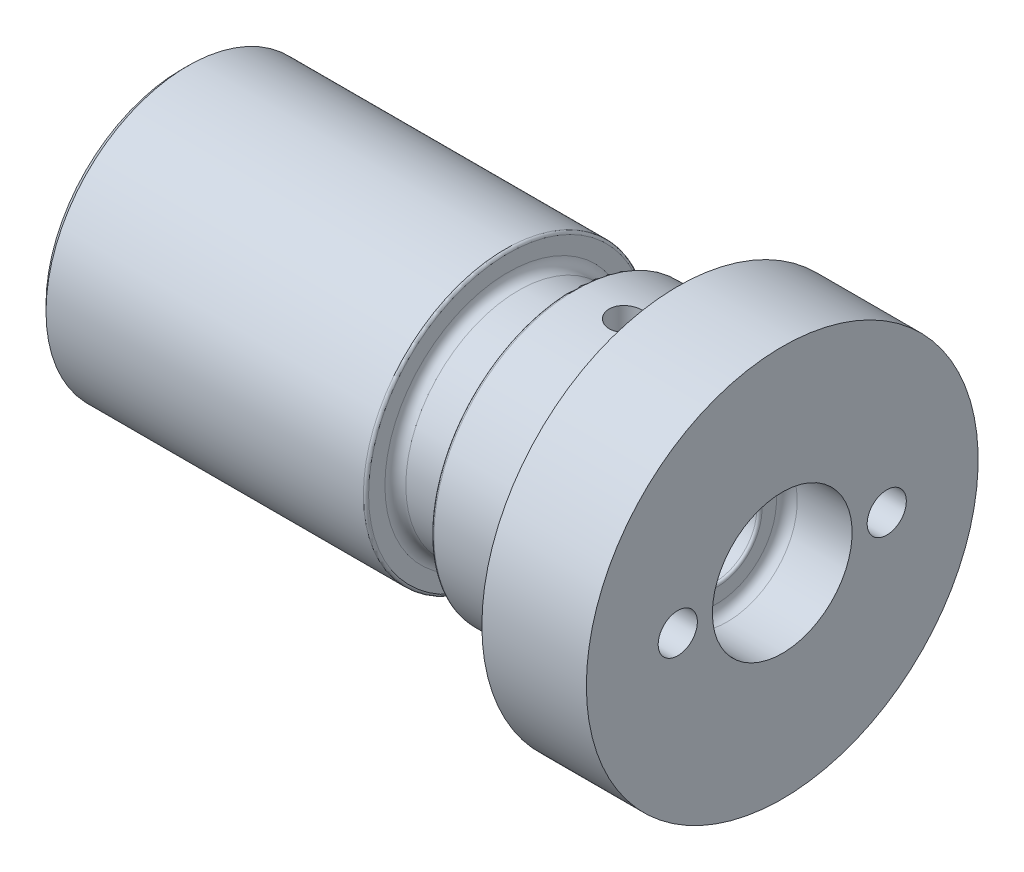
from build123d import *

# Parameters (mm, degrees)
CHAMFER1_SIZE      = 0.5
FILLET1_R          = 0.8
CIRPATTERN1_COUNT  = 2
CIRPATTERN2_COUNT  = 2
FILLET3_R          = 0.8
SKETCH9_W          = 3.05
SKETCH9_H          = 4.05
CUT_EXTRUDE1_DEPTH = 23
FILLET2_R          = 0.2


with BuildPart() as part:
    # Sketch1 → Base-Revolve (revolve)
    with BuildSketch(Plane.XY, mode=Mode.PRIVATE) as base_revolve_sk:
        Polygon((41, 3.25), (31.5, 3.25), (31.5, 6), (0, 6), (0, 10.875), (25, 10.875), (25, 8.625), (30, 8.625), (30, 10.875), (38, 10.875), (38, 15), (46, 15), (46, 5.35), (41, 5.35), align=None)
    revolve(base_revolve_sk.sketch.rotate(Axis((0, 0, 0), (1, 0, 0)), 90), axis=Axis((0, 0, 0), (1, 0, 0)))

    # Chamfer1
    chamfer1_edges = [part.edges().sort_by_distance(p)[0] for p in [
        (0, 0, -10.875),
    ]]
    chamfer(chamfer1_edges, length=CHAMFER1_SIZE)

    # Sketch5 → M3 Tapped Hole1 (revolve, cut)
    with BuildSketch(Plane(origin=(34, 11.125, 0), x_dir=(0, 0, 1), z_dir=(1, 0, 0))):
        Polygon((0, 0), (0, 7.251075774), (1.25, 6.5), (1.25, 0), align=None)
    m3_tapped_hole1 = revolve(axis=Axis((34, 17.475, 0), (0, -1, 0)), mode=Mode.SUBTRACT)

    # Fillet1
    fillet1_edges = [part.edges().sort_by_distance(p)[0] for p in [
        (30, 0, -8.625),
        (25, 0, -8.625),
    ]]
    fillet(fillet1_edges, radius=FILLET1_R)

    # Sketch7 → M3x0.5 Tapped Hole1 (revolve, cut)
    with BuildSketch(Plane(origin=(46, 0, -8), x_dir=(0, 0, -1), z_dir=(0, 1, 0))):
        Polygon((0, 0), (0, 9.901290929), (1.5, 9), (1.5, 0), align=None)
    m3x0_5_tapped_hole1 = revolve(axis=Axis((52.35, 0, -8), (-1, 0, 0)), mode=Mode.SUBTRACT)

    # CirPattern1: M3 Tapped Hole1 ×2 about axis
    cirpattern1_axis = Axis((0, 0, 0), (1, 0, 0))
    for i in range(1, CIRPATTERN1_COUNT):
        add(m3_tapped_hole1.rotate(cirpattern1_axis, i * 360 / CIRPATTERN1_COUNT), mode=Mode.SUBTRACT)

    # CirPattern2: M3x0.5 Tapped Hole1 ×2 about axis
    cirpattern2_axis = Axis((0, 0, 0), (1, 0, 0))
    for i in range(1, CIRPATTERN2_COUNT):
        add(m3x0_5_tapped_hole1.rotate(cirpattern2_axis, i * 360 / CIRPATTERN2_COUNT), mode=Mode.SUBTRACT)

    # Fillet3
    fillet3_edges = [part.edges().sort_by_distance(p)[0] for p in [
        (41, 0, -5.35),
    ]]
    fillet(fillet3_edges, radius=FILLET3_R)

    # Sketch9 → Cut-Extrude1 (cut)
    with BuildSketch(Plane.ZY):
        with Locations((0, 5.525)):
            Rectangle(SKETCH9_W, SKETCH9_H)
    extrude(amount=-CUT_EXTRUDE1_DEPTH, mode=Mode.SUBTRACT)

    # Fillet2
    fillet2_edges = [part.edges().sort_by_distance(p)[0] for p in [
        (30, 0, -10.875),
        (25, 0, -10.875),
        (41, 0, -3.25),
    ]]
    fillet(fillet2_edges, radius=FILLET2_R)


solid = part.part
